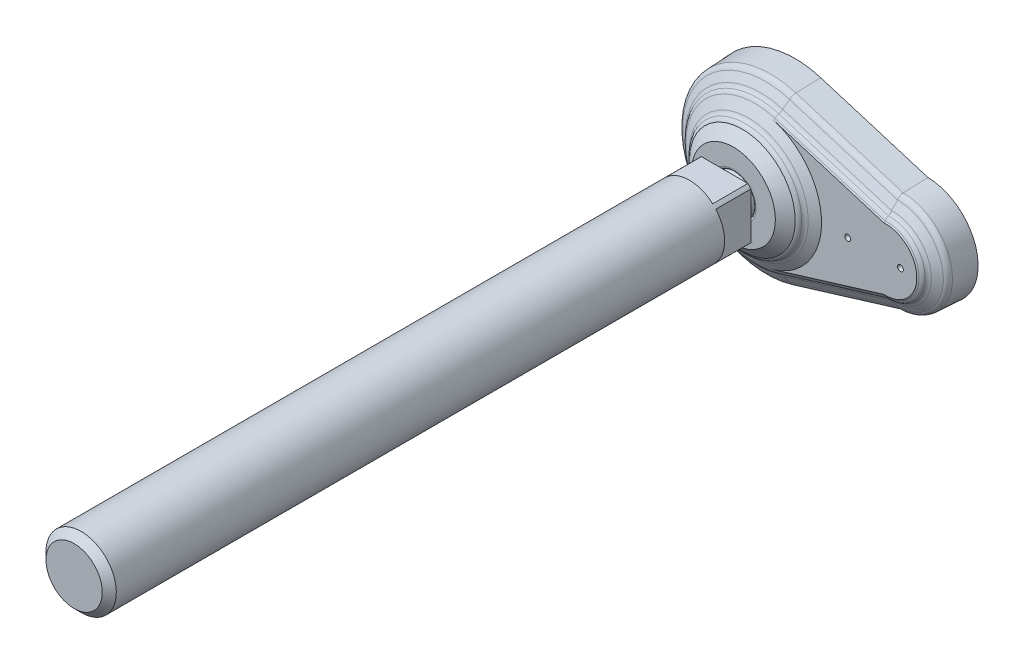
ISO-10303-21;
HEADER;
FILE_DESCRIPTION(('STEP AP214'),'2;1');
FILE_NAME('part.step','',(''),(''),'','','');
FILE_SCHEMA(('AUTOMOTIVE_DESIGN { 1 0 10303 214 1 1 1 1 }'));
ENDSEC;
DATA;
#1=APPLICATION_CONTEXT('core data for automotive mechanical design processes');
#2=APPLICATION_PROTOCOL_DEFINITION('international standard','automotive_design',2000,#1);
#3=PRODUCT_CONTEXT('',#1,'mechanical');
#4=PRODUCT('Part','Part','',(#3));
#5=PRODUCT_RELATED_PRODUCT_CATEGORY('part','',(#4));
#6=PRODUCT_DEFINITION_FORMATION('','',#4);
#7=PRODUCT_DEFINITION_CONTEXT('part definition',#1,'design');
#8=PRODUCT_DEFINITION('design','',#6,#7);
#9=PRODUCT_DEFINITION_SHAPE('','',#8);
#10=(LENGTH_UNIT() NAMED_UNIT(*) SI_UNIT(.MILLI.,.METRE.));
#11=(NAMED_UNIT(*) PLANE_ANGLE_UNIT() SI_UNIT($,.RADIAN.));
#12=(NAMED_UNIT(*) SI_UNIT($,.STERADIAN.) SOLID_ANGLE_UNIT());
#13=UNCERTAINTY_MEASURE_WITH_UNIT(LENGTH_MEASURE(1.E-05),#10,'distance_accuracy_value','');
#14=(GEOMETRIC_REPRESENTATION_CONTEXT(3) GLOBAL_UNCERTAINTY_ASSIGNED_CONTEXT((#13)) GLOBAL_UNIT_ASSIGNED_CONTEXT((#10,
#11,#12)) REPRESENTATION_CONTEXT('',''));
#15=CARTESIAN_POINT('',(0.,0.,0.));
#16=DIRECTION('',(0.,0.,1.));
#17=DIRECTION('',(1.,0.,0.));
#18=AXIS2_PLACEMENT_3D('',#15,#16,#17);
#19=CARTESIAN_POINT('',(0.,0.,36.));
#20=DIRECTION('',(0.,0.,1.));
#21=DIRECTION('',(-1.,0.,0.));
#22=AXIS2_PLACEMENT_3D('',#19,#20,#21);
#23=CYLINDRICAL_SURFACE('',#22,12.);
#24=CARTESIAN_POINT('',(0.,0.,243.6));
#25=DIRECTION('',(0.,0.,1.));
#26=DIRECTION('',(-1.,0.,0.));
#27=AXIS2_PLACEMENT_3D('',#24,#25,#26);
#28=CIRCLE('',#27,12.);
#29=CARTESIAN_POINT('',(-12.,0.,243.6));
#30=VERTEX_POINT('',#29);
#31=EDGE_CURVE('E9',#30,#30,#28,.F.);
#32=ORIENTED_EDGE('',*,*,#31,.T.);
#33=EDGE_LOOP('',(#32));
#34=FACE_BOUND('',#33,.T.);
#35=DIRECTION('',(0.,0.,1.));
#36=VECTOR('',#35,1.);
#37=CARTESIAN_POINT('',(-7.93725393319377,-9.,36.));
#38=LINE('',#37,#36);
#39=CARTESIAN_POINT('',(-7.93725393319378,-9.,36.));
#40=VERTEX_POINT('',#39);
#41=CARTESIAN_POINT('',(-7.93725393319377,-9.,24.));
#42=VERTEX_POINT('',#41);
#43=EDGE_CURVE('E136',#40,#42,#38,.F.);
#44=ORIENTED_EDGE('',*,*,#43,.F.);
#45=CARTESIAN_POINT('',(0.,0.,36.));
#46=DIRECTION('',(0.,0.,1.));
#47=DIRECTION('',(0.,-1.,0.));
#48=AXIS2_PLACEMENT_3D('',#45,#46,#47);
#49=CIRCLE('',#48,12.);
#50=CARTESIAN_POINT('',(7.93725393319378,-9.,36.));
#51=VERTEX_POINT('',#50);
#52=EDGE_CURVE('E598',#40,#51,#49,.T.);
#53=ORIENTED_EDGE('',*,*,#52,.T.);
#54=DIRECTION('',(0.,0.,1.));
#55=VECTOR('',#54,1.);
#56=CARTESIAN_POINT('',(7.93725393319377,-9.,36.));
#57=LINE('',#56,#55);
#58=CARTESIAN_POINT('',(7.93725393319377,-9.,24.));
#59=VERTEX_POINT('',#58);
#60=EDGE_CURVE('E201',#59,#51,#57,.T.);
#61=ORIENTED_EDGE('',*,*,#60,.F.);
#62=CARTESIAN_POINT('',(0.,0.,24.));
#63=DIRECTION('',(0.,0.,1.));
#64=DIRECTION('',(-1.,0.,0.));
#65=AXIS2_PLACEMENT_3D('',#62,#63,#64);
#66=CIRCLE('',#65,12.);
#67=CARTESIAN_POINT('',(9.,-7.93725393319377,24.));
#68=VERTEX_POINT('',#67);
#69=EDGE_CURVE('E184',#59,#68,#66,.T.);
#70=ORIENTED_EDGE('',*,*,#69,.T.);
#71=DIRECTION('',(0.,0.,1.));
#72=VECTOR('',#71,1.);
#73=CARTESIAN_POINT('',(9.,-7.93725393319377,36.));
#74=LINE('',#73,#72);
#75=CARTESIAN_POINT('',(9.,-7.93725393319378,36.));
#76=VERTEX_POINT('',#75);
#77=EDGE_CURVE('E198',#76,#68,#74,.F.);
#78=ORIENTED_EDGE('',*,*,#77,.F.);
#79=CARTESIAN_POINT('',(9.,7.93725393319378,36.));
#80=VERTEX_POINT('',#79);
#81=EDGE_CURVE('E266',#76,#80,#49,.T.);
#82=ORIENTED_EDGE('',*,*,#81,.T.);
#83=DIRECTION('',(0.,0.,1.));
#84=VECTOR('',#83,1.);
#85=CARTESIAN_POINT('',(9.,7.93725393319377,36.));
#86=LINE('',#85,#84);
#87=CARTESIAN_POINT('',(9.,7.93725393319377,24.));
#88=VERTEX_POINT('',#87);
#89=EDGE_CURVE('E243',#88,#80,#86,.T.);
#90=ORIENTED_EDGE('',*,*,#89,.F.);
#91=CARTESIAN_POINT('',(7.93725393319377,9.,24.));
#92=VERTEX_POINT('',#91);
#93=EDGE_CURVE('E180',#88,#92,#66,.T.);
#94=ORIENTED_EDGE('',*,*,#93,.T.);
#95=DIRECTION('',(0.,0.,1.));
#96=VECTOR('',#95,1.);
#97=CARTESIAN_POINT('',(7.93725393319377,9.,36.));
#98=LINE('',#97,#96);
#99=CARTESIAN_POINT('',(7.93725393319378,9.,36.));
#100=VERTEX_POINT('',#99);
#101=EDGE_CURVE('E161',#100,#92,#98,.F.);
#102=ORIENTED_EDGE('',*,*,#101,.F.);
#103=CARTESIAN_POINT('',(-7.93725393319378,9.,36.));
#104=VERTEX_POINT('',#103);
#105=EDGE_CURVE('E174',#100,#104,#49,.T.);
#106=ORIENTED_EDGE('',*,*,#105,.T.);
#107=DIRECTION('',(0.,0.,1.));
#108=VECTOR('',#107,1.);
#109=CARTESIAN_POINT('',(-7.93725393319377,9.,36.));
#110=LINE('',#109,#108);
#111=CARTESIAN_POINT('',(-7.93725393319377,9.,24.));
#112=VERTEX_POINT('',#111);
#113=EDGE_CURVE('E159',#112,#104,#110,.T.);
#114=ORIENTED_EDGE('',*,*,#113,.F.);
#115=CARTESIAN_POINT('',(-9.,7.93725393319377,24.));
#116=VERTEX_POINT('',#115);
#117=EDGE_CURVE('E172',#112,#116,#66,.T.);
#118=ORIENTED_EDGE('',*,*,#117,.T.);
#119=DIRECTION('',(0.,0.,1.));
#120=VECTOR('',#119,1.);
#121=CARTESIAN_POINT('',(-9.,7.93725393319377,36.));
#122=LINE('',#121,#120);
#123=CARTESIAN_POINT('',(-9.,7.93725393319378,36.));
#124=VERTEX_POINT('',#123);
#125=EDGE_CURVE('E175',#124,#116,#122,.F.);
#126=ORIENTED_EDGE('',*,*,#125,.F.);
#127=CARTESIAN_POINT('',(-9.,-7.93725393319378,36.));
#128=VERTEX_POINT('',#127);
#129=EDGE_CURVE('E599',#124,#128,#49,.T.);
#130=ORIENTED_EDGE('',*,*,#129,.T.);
#131=DIRECTION('',(0.,0.,1.));
#132=VECTOR('',#131,1.);
#133=CARTESIAN_POINT('',(-9.,-7.93725393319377,36.));
#134=LINE('',#133,#132);
#135=CARTESIAN_POINT('',(-9.,-7.93725393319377,24.));
#136=VERTEX_POINT('',#135);
#137=EDGE_CURVE('E181',#136,#128,#134,.T.);
#138=ORIENTED_EDGE('',*,*,#137,.F.);
#139=EDGE_CURVE('E183',#136,#42,#66,.T.);
#140=ORIENTED_EDGE('',*,*,#139,.T.);
#141=EDGE_LOOP('',(#44,#53,#61,#70,#78,#82,#90,#94,#102,#106,#114,#118,#126,#130,#138,#140));
#142=FACE_BOUND('',#141,.T.);
#143=ADVANCED_FACE('F14',(#34,#142),#23,.T.);
#144=CARTESIAN_POINT('',(-5.24903501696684,0.,24.));
#145=DIRECTION('',(0.,0.,1.));
#146=DIRECTION('',(-1.,0.,0.));
#147=AXIS2_PLACEMENT_3D('',#144,#145,#146);
#148=PLANE('',#147);
#149=DIRECTION('',(0.,-1.,0.));
#150=VECTOR('',#149,1.);
#151=CARTESIAN_POINT('',(-9.,9.,24.));
#152=LINE('',#151,#150);
#153=EDGE_CURVE('E31',#116,#136,#152,.T.);
#154=ORIENTED_EDGE('',*,*,#153,.F.);
#155=ORIENTED_EDGE('',*,*,#117,.F.);
#156=DIRECTION('',(-1.,0.,0.));
#157=VECTOR('',#156,1.);
#158=CARTESIAN_POINT('',(9.,9.,24.));
#159=LINE('',#158,#157);
#160=EDGE_CURVE('E154',#92,#112,#159,.T.);
#161=ORIENTED_EDGE('',*,*,#160,.F.);
#162=ORIENTED_EDGE('',*,*,#93,.F.);
#163=DIRECTION('',(0.,1.,0.));
#164=VECTOR('',#163,1.);
#165=CARTESIAN_POINT('',(9.,-9.,24.));
#166=LINE('',#165,#164);
#167=EDGE_CURVE('E166',#68,#88,#166,.T.);
#168=ORIENTED_EDGE('',*,*,#167,.F.);
#169=ORIENTED_EDGE('',*,*,#69,.F.);
#170=DIRECTION('',(1.,0.,0.));
#171=VECTOR('',#170,1.);
#172=CARTESIAN_POINT('',(-9.,-9.,24.));
#173=LINE('',#172,#171);
#174=EDGE_CURVE('E203',#42,#59,#173,.T.);
#175=ORIENTED_EDGE('',*,*,#174,.F.);
#176=ORIENTED_EDGE('',*,*,#139,.F.);
#177=EDGE_LOOP('',(#154,#155,#161,#162,#168,#169,#175,#176));
#178=FACE_BOUND('',#177,.T.);
#179=CARTESIAN_POINT('',(0.,0.,24.));
#180=DIRECTION('',(0.,0.,1.));
#181=DIRECTION('',(-1.,0.,0.));
#182=AXIS2_PLACEMENT_3D('',#179,#180,#181);
#183=CIRCLE('',#182,5.24903501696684);
#184=CARTESIAN_POINT('',(-5.24903501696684,0.,24.));
#185=VERTEX_POINT('',#184);
#186=EDGE_CURVE('E189',#185,#185,#183,.T.);
#187=ORIENTED_EDGE('',*,*,#186,.T.);
#188=EDGE_LOOP('',(#187));
#189=FACE_BOUND('',#188,.T.);
#190=ADVANCED_FACE('F177',(#178,#189),#148,.F.);
#191=CARTESIAN_POINT('',(0.,0.,17.6309999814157));
#192=DIRECTION('',(0.,0.,1.));
#193=DIRECTION('',(-1.,0.,0.));
#194=AXIS2_PLACEMENT_3D('',#191,#192,#193);
#195=DEGENERATE_TOROIDAL_SURFACE('',#194,0.0005038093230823,6.829,.T.);
#196=CARTESIAN_POINT('',(0.,0.,18.775));
#197=DIRECTION('',(0.,0.,-1.));
#198=DIRECTION('',(1.,0.,0.));
#199=AXIS2_PLACEMENT_3D('',#196,#197,#198);
#200=CIRCLE('',#199,6.733);
#201=CARTESIAN_POINT('',(6.733,0.,18.775));
#202=VERTEX_POINT('',#201);
#203=EDGE_CURVE('E250',#202,#202,#200,.T.);
#204=ORIENTED_EDGE('',*,*,#203,.F.);
#205=EDGE_LOOP('',(#204));
#206=FACE_BOUND('',#205,.T.);
#207=CARTESIAN_POINT('',(0.,0.,22.));
#208=DIRECTION('',(0.,0.,1.));
#209=DIRECTION('',(-1.,0.,0.));
#210=AXIS2_PLACEMENT_3D('',#207,#208,#209);
#211=CIRCLE('',#210,5.24903501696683);
#212=CARTESIAN_POINT('',(-5.24903501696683,0.,22.));
#213=VERTEX_POINT('',#212);
#214=EDGE_CURVE('E191',#213,#213,#211,.T.);
#215=ORIENTED_EDGE('',*,*,#214,.F.);
#216=EDGE_LOOP('',(#215));
#217=FACE_BOUND('',#216,.T.);
#218=ADVANCED_FACE('F472',(#206,#217),#195,.T.);
#219=CARTESIAN_POINT('',(0.,0.,36.));
#220=DIRECTION('',(0.,0.,1.));
#221=DIRECTION('',(-1.,0.,0.));
#222=AXIS2_PLACEMENT_3D('',#219,#220,#221);
#223=CYLINDRICAL_SURFACE('',#222,5.24903501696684);
#224=ORIENTED_EDGE('',*,*,#186,.F.);
#225=EDGE_LOOP('',(#224));
#226=FACE_BOUND('',#225,.T.);
#227=ORIENTED_EDGE('',*,*,#214,.T.);
#228=EDGE_LOOP('',(#227));
#229=FACE_BOUND('',#228,.T.);
#230=ADVANCED_FACE('F574',(#226,#229),#223,.T.);
#231=CARTESIAN_POINT('',(-9.,-9.,24.));
#232=DIRECTION('',(0.,-1.,0.));
#233=DIRECTION('',(1.,0.,0.));
#234=AXIS2_PLACEMENT_3D('',#231,#232,#233);
#235=PLANE('',#234);
#236=ORIENTED_EDGE('',*,*,#60,.T.);
#237=DIRECTION('',(-1.,0.,0.));
#238=VECTOR('',#237,1.);
#239=CARTESIAN_POINT('',(-12.,-9.,36.));
#240=LINE('',#239,#238);
#241=EDGE_CURVE('E215',#51,#40,#240,.T.);
#242=ORIENTED_EDGE('',*,*,#241,.T.);
#243=ORIENTED_EDGE('',*,*,#43,.T.);
#244=ORIENTED_EDGE('',*,*,#174,.T.);
#245=EDGE_LOOP('',(#236,#242,#243,#244));
#246=FACE_BOUND('',#245,.T.);
#247=ADVANCED_FACE('F572',(#246),#235,.T.);
#248=CARTESIAN_POINT('',(9.,-9.,24.));
#249=DIRECTION('',(1.,0.,0.));
#250=DIRECTION('',(0.,1.,0.));
#251=AXIS2_PLACEMENT_3D('',#248,#249,#250);
#252=PLANE('',#251);
#253=ORIENTED_EDGE('',*,*,#89,.T.);
#254=DIRECTION('',(0.,-1.,0.));
#255=VECTOR('',#254,1.);
#256=CARTESIAN_POINT('',(9.,0.,36.));
#257=LINE('',#256,#255);
#258=EDGE_CURVE('E222',#80,#76,#257,.T.);
#259=ORIENTED_EDGE('',*,*,#258,.T.);
#260=ORIENTED_EDGE('',*,*,#77,.T.);
#261=ORIENTED_EDGE('',*,*,#167,.T.);
#262=EDGE_LOOP('',(#253,#259,#260,#261));
#263=FACE_BOUND('',#262,.T.);
#264=ADVANCED_FACE('F568',(#263),#252,.T.);
#265=CARTESIAN_POINT('',(9.,9.,24.));
#266=DIRECTION('',(0.,1.,0.));
#267=DIRECTION('',(-1.,0.,0.));
#268=AXIS2_PLACEMENT_3D('',#265,#266,#267);
#269=PLANE('',#268);
#270=ORIENTED_EDGE('',*,*,#113,.T.);
#271=DIRECTION('',(1.,0.,0.));
#272=VECTOR('',#271,1.);
#273=CARTESIAN_POINT('',(-12.,9.,36.));
#274=LINE('',#273,#272);
#275=EDGE_CURVE('E226',#104,#100,#274,.T.);
#276=ORIENTED_EDGE('',*,*,#275,.T.);
#277=ORIENTED_EDGE('',*,*,#101,.T.);
#278=ORIENTED_EDGE('',*,*,#160,.T.);
#279=EDGE_LOOP('',(#270,#276,#277,#278));
#280=FACE_BOUND('',#279,.T.);
#281=ADVANCED_FACE('F156',(#280),#269,.T.);
#282=CARTESIAN_POINT('',(-9.,9.,24.));
#283=DIRECTION('',(-1.,0.,0.));
#284=DIRECTION('',(0.,-1.,0.));
#285=AXIS2_PLACEMENT_3D('',#282,#283,#284);
#286=PLANE('',#285);
#287=ORIENTED_EDGE('',*,*,#137,.T.);
#288=DIRECTION('',(0.,1.,0.));
#289=VECTOR('',#288,1.);
#290=CARTESIAN_POINT('',(-9.,0.,36.));
#291=LINE('',#290,#289);
#292=EDGE_CURVE('E239',#128,#124,#291,.T.);
#293=ORIENTED_EDGE('',*,*,#292,.T.);
#294=ORIENTED_EDGE('',*,*,#125,.T.);
#295=ORIENTED_EDGE('',*,*,#153,.T.);
#296=EDGE_LOOP('',(#287,#293,#294,#295));
#297=FACE_BOUND('',#296,.T.);
#298=ADVANCED_FACE('F482',(#297),#286,.T.);
#299=CARTESIAN_POINT('',(45.,0.,0.));
#300=DIRECTION('',(0.,0.,-1.));
#301=DIRECTION('',(0.,1.,0.));
#302=AXIS2_PLACEMENT_3D('',#299,#300,#301);
#303=CONICAL_SURFACE('',#302,17.5,0.0523365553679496);
#304=CARTESIAN_POINT('',(45.,0.,8.304));
#305=DIRECTION('',(0.,0.,1.));
#306=DIRECTION('',(0.,-1.,0.));
#307=AXIS2_PLACEMENT_3D('',#304,#305,#306);
#308=CIRCLE('',#307,17.065);
#309=CARTESIAN_POINT('',(45.3136024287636,-17.0621182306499,8.304));
#310=VERTEX_POINT('',#309);
#311=CARTESIAN_POINT('',(45.3136024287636,17.0621182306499,8.304));
#312=VERTEX_POINT('',#311);
#313=EDGE_CURVE('E304',#310,#312,#308,.T.);
#314=ORIENTED_EDGE('',*,*,#313,.F.);
#315=CARTESIAN_POINT('',(45.3136007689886,-17.0621077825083,8.3042));
#316=CARTESIAN_POINT('',(45.3250873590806,-17.134412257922,6.92013380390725));
#317=CARTESIAN_POINT('',(45.3366049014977,-17.206707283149,5.5360673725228));
#318=CARTESIAN_POINT('',(45.3597018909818,-17.3512784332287,2.76793403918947));
#319=CARTESIAN_POINT('',(45.3712813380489,-17.4235545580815,1.38386713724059));
#320=CARTESIAN_POINT('',(45.3828917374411,-17.4958212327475,-0.000200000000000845));
#321=B_SPLINE_CURVE_WITH_KNOTS('',3,(#315,#316,#317,#318,#319,#320),.UNSPECIFIED.,.F.,.F.,(4,2,
4),(0.,4.15800336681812,8.31600673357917),.UNSPECIFIED.);
#322=CARTESIAN_POINT('',(45.3828900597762,-17.4958107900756,0.));
#323=VERTEX_POINT('',#322);
#324=EDGE_CURVE('E949',#310,#323,#321,.T.);
#325=ORIENTED_EDGE('',*,*,#324,.T.);
#326=CARTESIAN_POINT('',(45.,0.,0.));
#327=DIRECTION('',(0.,0.,1.));
#328=DIRECTION('',(0.,-1.,0.));
#329=AXIS2_PLACEMENT_3D('',#326,#327,#328);
#330=CIRCLE('',#329,17.5);
#331=CARTESIAN_POINT('',(45.3828900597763,17.4958107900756,0.));
#332=VERTEX_POINT('',#331);
#333=EDGE_CURVE('E307',#323,#332,#330,.T.);
#334=ORIENTED_EDGE('',*,*,#333,.T.);
#335=CARTESIAN_POINT('',(45.3828917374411,17.4958212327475,-0.000200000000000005));
#336=CARTESIAN_POINT('',(45.371281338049,17.4235545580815,1.38386713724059));
#337=CARTESIAN_POINT('',(45.359701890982,17.3512784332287,2.76793403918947));
#338=CARTESIAN_POINT('',(45.3366049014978,17.206707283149,5.5360673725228));
#339=CARTESIAN_POINT('',(45.3250873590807,17.134412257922,6.92013380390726));
#340=CARTESIAN_POINT('',(45.3136007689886,17.0621077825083,8.3042));
#341=B_SPLINE_CURVE_WITH_KNOTS('',3,(#335,#336,#337,#338,#339,#340),.UNSPECIFIED.,.F.,.F.,(4,2,
4),(0.,4.15800336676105,8.31600673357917),.UNSPECIFIED.);
#342=EDGE_CURVE('E942',#332,#312,#341,.T.);
#343=ORIENTED_EDGE('',*,*,#342,.T.);
#344=EDGE_LOOP('',(#314,#325,#334,#343));
#345=FACE_BOUND('',#344,.T.);
#346=ADVANCED_FACE('F362',(#345),#303,.T.);
#347=CARTESIAN_POINT('',(46.8961596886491,-16.5782819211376,8.304));
#348=DIRECTION('',(-0.291971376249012,0.9549953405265,-0.0523126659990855));
#349=DIRECTION('',(-0.956304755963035,-0.292371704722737,0.));
#350=AXIS2_PLACEMENT_3D('',#347,#348,#349);
#351=PLANE('',#350);
#352=ORIENTED_EDGE('',*,*,#324,.F.);
#353=DIRECTION('',(-0.956304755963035,-0.292371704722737,0.));
#354=VECTOR('',#353,1.);
#355=CARTESIAN_POINT('',(46.8961596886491,-16.5782819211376,8.304));
#356=LINE('',#355,#354);
#357=CARTESIAN_POINT('',(8.64396945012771,-28.2731501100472,8.304));
#358=VERTEX_POINT('',#357);
#359=EDGE_CURVE('E974',#310,#358,#356,.T.);
#360=ORIENTED_EDGE('',*,*,#359,.T.);
#361=DIRECTION('',(-0.0152947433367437,0.050026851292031,0.998630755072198));
#362=VECTOR('',#361,1.);
#363=CARTESIAN_POINT('',(8.7711511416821,-28.689142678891,0.));
#364=LINE('',#363,#362);
#365=CARTESIAN_POINT('',(8.7711511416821,-28.689142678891,0.));
#366=VERTEX_POINT('',#365);
#367=EDGE_CURVE('E987',#366,#358,#364,.T.);
#368=ORIENTED_EDGE('',*,*,#367,.F.);
#369=DIRECTION('',(-0.956304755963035,-0.292371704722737,0.));
#370=VECTOR('',#369,1.);
#371=CARTESIAN_POINT('',(47.0233413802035,-16.9942744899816,0.));
#372=LINE('',#371,#370);
#373=EDGE_CURVE('E127',#323,#366,#372,.T.);
#374=ORIENTED_EDGE('',*,*,#373,.F.);
#375=EDGE_LOOP('',(#352,#360,#368,#374));
#376=FACE_BOUND('',#375,.T.);
#377=ADVANCED_FACE('F468',(#376),#351,.F.);
#378=CARTESIAN_POINT('',(0.,0.,0.));
#379=DIRECTION('',(0.,0.,1.));
#380=DIRECTION('',(0.,-1.,0.));
#381=AXIS2_PLACEMENT_3D('',#378,#379,#380);
#382=PLANE('',#381);
#383=DIRECTION('',(-0.956304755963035,0.292371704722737,0.));
#384=VECTOR('',#383,1.);
#385=CARTESIAN_POINT('',(47.0233413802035,16.9942744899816,0.));
#386=LINE('',#385,#384);
#387=CARTESIAN_POINT('',(8.7711511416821,28.689142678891,0.));
#388=VERTEX_POINT('',#387);
#389=EDGE_CURVE('E972',#332,#388,#386,.T.);
#390=ORIENTED_EDGE('',*,*,#389,.F.);
#391=ORIENTED_EDGE('',*,*,#333,.F.);
#392=ORIENTED_EDGE('',*,*,#373,.T.);
#393=CARTESIAN_POINT('',(0.,0.,0.));
#394=DIRECTION('',(0.,0.,1.));
#395=DIRECTION('',(0.,-1.,0.));
#396=AXIS2_PLACEMENT_3D('',#393,#394,#395);
#397=CIRCLE('',#396,30.);
#398=EDGE_CURVE('E351',#388,#366,#397,.T.);
#399=ORIENTED_EDGE('',*,*,#398,.F.);
#400=EDGE_LOOP('',(#390,#391,#392,#399));
#401=FACE_BOUND('',#400,.T.);
#402=CARTESIAN_POINT('',(32.,0.,0.));
#403=DIRECTION('',(0.,0.,-1.));
#404=DIRECTION('',(0.,1.,0.));
#405=AXIS2_PLACEMENT_3D('',#402,#403,#404);
#406=CIRCLE('',#405,4.25);
#407=CARTESIAN_POINT('',(32.,4.25,0.));
#408=VERTEX_POINT('',#407);
#409=EDGE_CURVE('E600',#408,#408,#406,.T.);
#410=ORIENTED_EDGE('',*,*,#409,.F.);
#411=EDGE_LOOP('',(#410));
#412=FACE_BOUND('',#411,.T.);
#413=CARTESIAN_POINT('',(50.,0.,0.));
#414=DIRECTION('',(0.,0.,-1.));
#415=DIRECTION('',(0.,1.,0.));
#416=AXIS2_PLACEMENT_3D('',#413,#414,#415);
#417=CIRCLE('',#416,4.25);
#418=CARTESIAN_POINT('',(50.,4.25,0.));
#419=VERTEX_POINT('',#418);
#420=EDGE_CURVE('E603',#419,#419,#417,.T.);
#421=ORIENTED_EDGE('',*,*,#420,.F.);
#422=EDGE_LOOP('',(#421));
#423=FACE_BOUND('',#422,.T.);
#424=ADVANCED_FACE('F360',(#401,#412,#423),#382,.F.);
#425=CARTESIAN_POINT('',(47.0233413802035,16.9942744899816,0.));
#426=DIRECTION('',(-0.291971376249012,-0.9549953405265,-0.0523126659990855));
#427=DIRECTION('',(0.956304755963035,-0.292371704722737,0.));
#428=AXIS2_PLACEMENT_3D('',#425,#426,#427);
#429=PLANE('',#428);
#430=ORIENTED_EDGE('',*,*,#342,.F.);
#431=ORIENTED_EDGE('',*,*,#389,.T.);
#432=DIRECTION('',(-0.0152947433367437,-0.050026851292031,0.998630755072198));
#433=VECTOR('',#432,1.);
#434=CARTESIAN_POINT('',(8.7711511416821,28.689142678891,0.));
#435=LINE('',#434,#433);
#436=CARTESIAN_POINT('',(8.64396945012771,28.2731501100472,8.304));
#437=VERTEX_POINT('',#436);
#438=EDGE_CURVE('E1004',#388,#437,#435,.T.);
#439=ORIENTED_EDGE('',*,*,#438,.T.);
#440=DIRECTION('',(-0.956304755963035,0.292371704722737,0.));
#441=VECTOR('',#440,1.);
#442=CARTESIAN_POINT('',(46.8961596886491,16.5782819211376,8.304));
#443=LINE('',#442,#441);
#444=EDGE_CURVE('E970',#312,#437,#443,.T.);
#445=ORIENTED_EDGE('',*,*,#444,.F.);
#446=EDGE_LOOP('',(#430,#431,#439,#445));
#447=FACE_BOUND('',#446,.T.);
#448=ADVANCED_FACE('F438',(#447),#429,.F.);
#449=CARTESIAN_POINT('',(45.,0.,8.20868962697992));
#450=DIRECTION('',(0.,0.,1.));
#451=DIRECTION('',(0.,-1.,0.));
#452=AXIS2_PLACEMENT_3D('',#449,#450,#451);
#453=TOROIDAL_SURFACE('',#452,15.0672723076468,2.);
#454=CARTESIAN_POINT('',(45.313603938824,-17.062127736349,8.3038));
#455=CARTESIAN_POINT('',(45.3131828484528,-17.0594763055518,8.3596419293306));
#456=CARTESIAN_POINT('',(45.3123906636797,-17.0544900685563,8.41534315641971));
#457=CARTESIAN_POINT('',(45.3100724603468,-17.0398916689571,8.52611669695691));
#458=CARTESIAN_POINT('',(45.3085464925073,-17.0302798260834,8.5811890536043));
#459=CARTESIAN_POINT('',(45.3028875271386,-16.9946160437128,8.7447437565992));
#460=CARTESIAN_POINT('',(45.2976717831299,-16.9617253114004,8.85178061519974));
#461=CARTESIAN_POINT('',(45.284530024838,-16.8786837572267,9.05872519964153));
#462=CARTESIAN_POINT('',(45.2766032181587,-16.8285278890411,9.1586308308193));
#463=CARTESIAN_POINT('',(45.2583029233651,-16.7124179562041,9.34857034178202));
#464=CARTESIAN_POINT('',(45.24792931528,-16.6464631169,9.43860373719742));
#465=CARTESIAN_POINT('',(45.2250216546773,-16.5003240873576,9.60671335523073));
#466=CARTESIAN_POINT('',(45.2124772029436,-16.4200713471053,9.68472843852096));
#467=CARTESIAN_POINT('',(45.1856662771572,-16.2478592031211,9.8261370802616));
#468=CARTESIAN_POINT('',(45.1714009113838,-16.1559073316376,9.88953997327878));
#469=CARTESIAN_POINT('',(45.148748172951,-16.0092275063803,9.97356807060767));
#470=CARTESIAN_POINT('',(45.1408156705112,-15.957749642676,10.0001426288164));
#471=CARTESIAN_POINT('',(45.1246863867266,-15.8528232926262,10.0486569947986));
#472=CARTESIAN_POINT('',(45.1164901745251,-15.7993790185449,10.0706061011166));
#473=CARTESIAN_POINT('',(45.1081834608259,-15.7450737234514,10.0902));
#474=B_SPLINE_CURVE_WITH_KNOTS('',3,(#454,#455,#456,#457,#458,#459,#460,#461,#462,#463,#464,
#465,#466,#467,#468,#469,#470,#471,#472,#473),.UNSPECIFIED.,.F.,.F.,(4,2,2,2,2,2,2,2,2,4),(0.,
0.167615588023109,0.335219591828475,0.669784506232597,1.00444729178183,1.33912648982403,
1.67545571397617,2.01156948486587,2.1867983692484,2.36167155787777),.UNSPECIFIED.);
#475=CARTESIAN_POINT('',(45.108268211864,-15.7456277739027,10.09));
#476=VERTEX_POINT('',#475);
#477=EDGE_CURVE('E950',#310,#476,#474,.T.);
#478=ORIENTED_EDGE('',*,*,#477,.F.);
#479=ORIENTED_EDGE('',*,*,#313,.T.);
#480=CARTESIAN_POINT('',(45.1081834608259,15.7450737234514,10.0902));
#481=CARTESIAN_POINT('',(45.1162755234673,15.7979756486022,10.0711117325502));
#482=CARTESIAN_POINT('',(45.1242625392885,15.8500594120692,10.0497900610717));
#483=CARTESIAN_POINT('',(45.1399729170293,15.9522733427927,10.0028085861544));
#484=CARTESIAN_POINT('',(45.1476962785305,16.0024035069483,9.97714877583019));
#485=CARTESIAN_POINT('',(45.170371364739,16.1492634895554,9.89392549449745));
#486=CARTESIAN_POINT('',(45.1848488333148,16.2425982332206,9.83006921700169));
#487=CARTESIAN_POINT('',(45.2120467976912,16.4173167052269,9.6873614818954));
#488=CARTESIAN_POINT('',(45.2247661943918,16.4986929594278,9.60850071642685));
#489=CARTESIAN_POINT('',(45.2480269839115,16.647087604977,9.4379734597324));
#490=CARTESIAN_POINT('',(45.2585686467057,16.7141077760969,9.34630855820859));
#491=CARTESIAN_POINT('',(45.2770522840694,16.8313730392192,9.15345563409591));
#492=CARTESIAN_POINT('',(45.2850114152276,16.8817288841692,9.05233645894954));
#493=CARTESIAN_POINT('',(45.298151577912,16.9647535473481,8.84294631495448));
#494=CARTESIAN_POINT('',(45.3033350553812,16.9974379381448,8.73468173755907));
#495=CARTESIAN_POINT('',(45.3088197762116,17.0320013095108,8.57167924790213));
#496=CARTESIAN_POINT('',(45.3102579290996,17.0410597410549,8.51840996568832));
#497=CARTESIAN_POINT('',(45.3124461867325,17.0548396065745,8.41140374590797));
#498=CARTESIAN_POINT('',(45.3131976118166,17.0595693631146,8.35766790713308));
#499=CARTESIAN_POINT('',(45.313603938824,17.062127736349,8.3038));
#500=B_SPLINE_CURVE_WITH_KNOTS('',3,(#480,#481,#482,#483,#484,#485,#486,#487,#488,#489,#490,
#491,#492,#493,#494,#495,#496,#497,#498,#499),.UNSPECIFIED.,.F.,.F.,(4,2,2,2,2,2,2,2,2,4),(0.,
0.170355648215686,0.340711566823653,0.680992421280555,1.02148505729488,1.36193545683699,
1.70007548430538,2.03791704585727,2.19992239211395,2.36161559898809),.UNSPECIFIED.);
#501=CARTESIAN_POINT('',(45.1082682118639,15.7456277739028,10.09));
#502=VERTEX_POINT('',#501);
#503=EDGE_CURVE('E427',#502,#312,#500,.T.);
#504=ORIENTED_EDGE('',*,*,#503,.F.);
#505=CARTESIAN_POINT('',(45.,0.,10.09));
#506=DIRECTION('',(0.,0.,1.));
#507=DIRECTION('',(0.,-1.,0.));
#508=AXIS2_PLACEMENT_3D('',#505,#506,#507);
#509=CIRCLE('',#508,15.746);
#510=EDGE_CURVE('E301',#476,#502,#509,.T.);
#511=ORIENTED_EDGE('',*,*,#510,.F.);
#512=EDGE_LOOP('',(#478,#479,#504,#511));
#513=FACE_BOUND('',#512,.T.);
#514=ADVANCED_FACE('F411',(#513),#453,.T.);
#515=CARTESIAN_POINT('',(46.312080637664,-14.6678454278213,8.20868962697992));
#516=DIRECTION('',(-0.956304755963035,-0.292371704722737,0.));
#517=DIRECTION('',(0.292371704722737,-0.956304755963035,0.));
#518=AXIS2_PLACEMENT_3D('',#515,#516,#517);
#519=CYLINDRICAL_SURFACE('',#518,2.);
#520=ORIENTED_EDGE('',*,*,#359,.F.);
#521=ORIENTED_EDGE('',*,*,#477,.T.);
#522=DIRECTION('',(-0.956304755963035,-0.292371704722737,0.));
#523=VECTOR('',#522,1.);
#524=CARTESIAN_POINT('',(46.5105214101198,-15.3169159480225,10.09));
#525=LINE('',#524,#523);
#526=CARTESIAN_POINT('',(8.25833117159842,-27.0117841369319,10.09));
#527=VERTEX_POINT('',#526);
#528=EDGE_CURVE('E976',#476,#527,#525,.T.);
#529=ORIENTED_EDGE('',*,*,#528,.T.);
#530=CARTESIAN_POINT('',(8.05989039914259,-26.3627136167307,8.20868962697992));
#531=DIRECTION('',(0.956304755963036,0.292371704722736,0.));
#532=DIRECTION('',(-0.292371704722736,0.956304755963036,0.));
#533=AXIS2_PLACEMENT_3D('',#530,#531,#532);
#534=CIRCLE('',#533,2.);
#535=EDGE_CURVE('E990',#527,#358,#534,.T.);
#536=ORIENTED_EDGE('',*,*,#535,.T.);
#537=EDGE_LOOP('',(#520,#521,#529,#536));
#538=FACE_BOUND('',#537,.T.);
#539=ADVANCED_FACE('F439',(#538),#519,.T.);
#540=CARTESIAN_POINT('',(0.,0.,0.));
#541=DIRECTION('',(0.,0.,-1.));
#542=DIRECTION('',(0.,1.,0.));
#543=AXIS2_PLACEMENT_3D('',#540,#541,#542);
#544=CONICAL_SURFACE('',#543,30.,0.0523365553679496);
#545=CARTESIAN_POINT('',(0.,0.,8.304));
#546=DIRECTION('',(0.,0.,1.));
#547=DIRECTION('',(0.,-1.,0.));
#548=AXIS2_PLACEMENT_3D('',#545,#546,#547);
#549=CIRCLE('',#548,29.565);
#550=EDGE_CURVE('E1033',#437,#358,#549,.T.);
#551=ORIENTED_EDGE('',*,*,#550,.F.);
#552=ORIENTED_EDGE('',*,*,#438,.F.);
#553=ORIENTED_EDGE('',*,*,#398,.T.);
#554=ORIENTED_EDGE('',*,*,#367,.T.);
#555=EDGE_LOOP('',(#551,#552,#553,#554));
#556=FACE_BOUND('',#555,.T.);
#557=ADVANCED_FACE('F459',(#556),#544,.T.);
#558=CARTESIAN_POINT('',(46.312080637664,14.6678454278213,8.20868962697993));
#559=DIRECTION('',(-0.956304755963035,0.292371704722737,0.));
#560=DIRECTION('',(-0.292371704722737,-0.956304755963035,0.));
#561=AXIS2_PLACEMENT_3D('',#558,#559,#560);
#562=CYLINDRICAL_SURFACE('',#561,2.);
#563=DIRECTION('',(-0.956304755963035,0.292371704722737,0.));
#564=VECTOR('',#563,1.);
#565=CARTESIAN_POINT('',(46.5105214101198,15.3169159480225,10.09));
#566=LINE('',#565,#564);
#567=CARTESIAN_POINT('',(8.25833117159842,27.0117841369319,10.09));
#568=VERTEX_POINT('',#567);
#569=EDGE_CURVE('E968',#502,#568,#566,.T.);
#570=ORIENTED_EDGE('',*,*,#569,.F.);
#571=ORIENTED_EDGE('',*,*,#503,.T.);
#572=ORIENTED_EDGE('',*,*,#444,.T.);
#573=CARTESIAN_POINT('',(8.05989039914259,26.3627136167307,8.20868962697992));
#574=DIRECTION('',(-0.956304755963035,0.292371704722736,0.));
#575=DIRECTION('',(-0.292371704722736,-0.956304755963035,0.));
#576=AXIS2_PLACEMENT_3D('',#573,#574,#575);
#577=CIRCLE('',#576,2.);
#578=EDGE_CURVE('E1007',#568,#437,#577,.T.);
#579=ORIENTED_EDGE('',*,*,#578,.F.);
#580=EDGE_LOOP('',(#570,#571,#572,#579));
#581=FACE_BOUND('',#580,.T.);
#582=ADVANCED_FACE('F370',(#581),#562,.T.);
#583=CARTESIAN_POINT('',(45.,0.,10.09));
#584=DIRECTION('',(0.,0.,-1.));
#585=DIRECTION('',(0.,1.,0.));
#586=AXIS2_PLACEMENT_3D('',#583,#584,#585);
#587=CONICAL_SURFACE('',#586,15.746,0.993858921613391);
#588=CARTESIAN_POINT('',(45.,0.,11.7170000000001));
#589=DIRECTION('',(0.,0.,1.));
#590=DIRECTION('',(0.,-1.,0.));
#591=AXIS2_PLACEMENT_3D('',#588,#589,#590);
#592=CIRCLE('',#591,13.2459999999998);
#593=CARTESIAN_POINT('',(44.7416637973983,-13.243480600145,11.7170000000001));
#594=VERTEX_POINT('',#593);
#595=CARTESIAN_POINT('',(44.7416637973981,13.2434806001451,11.7170000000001));
#596=VERTEX_POINT('',#595);
#597=EDGE_CURVE('E299',#594,#596,#592,.T.);
#598=ORIENTED_EDGE('',*,*,#597,.F.);
#599=CARTESIAN_POINT('',(44.7416208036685,-13.2431723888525,11.7172000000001));
#600=CARTESIAN_POINT('',(44.8000092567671,-13.66082442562,11.4461588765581));
#601=CARTESIAN_POINT('',(44.8597613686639,-14.078214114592,11.1750215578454));
#602=CARTESIAN_POINT('',(44.9819928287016,-14.9124682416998,10.6325548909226));
#603=CARTESIAN_POINT('',(45.0444721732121,-15.3293326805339,10.3612255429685));
#604=CARTESIAN_POINT('',(45.1083151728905,-15.745934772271,10.0898));
#605=B_SPLINE_CURVE_WITH_KNOTS('',3,(#599,#600,#601,#602,#603,#604),.UNSPECIFIED.,.F.,.F.,(4,2,
4),(0.,1.50389468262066,3.0077873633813),.UNSPECIFIED.);
#606=EDGE_CURVE('E420',#594,#476,#605,.T.);
#607=ORIENTED_EDGE('',*,*,#606,.T.);
#608=ORIENTED_EDGE('',*,*,#510,.T.);
#609=CARTESIAN_POINT('',(45.1083151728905,15.745934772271,10.0898));
#610=CARTESIAN_POINT('',(45.0444721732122,15.3293326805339,10.3612255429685));
#611=CARTESIAN_POINT('',(44.9819928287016,14.9124682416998,10.6325548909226));
#612=CARTESIAN_POINT('',(44.8597613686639,14.078214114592,11.1750215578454));
#613=CARTESIAN_POINT('',(44.8000092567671,13.66082442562,11.4461588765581));
#614=CARTESIAN_POINT('',(44.7416208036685,13.2431723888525,11.7172000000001));
#615=B_SPLINE_CURVE_WITH_KNOTS('',3,(#609,#610,#611,#612,#613,#614),.UNSPECIFIED.,.F.,.F.,(4,2,
4),(0.,1.50389268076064,3.0077873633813),.UNSPECIFIED.);
#616=EDGE_CURVE('E414',#502,#596,#615,.T.);
#617=ORIENTED_EDGE('',*,*,#616,.T.);
#618=EDGE_LOOP('',(#598,#607,#608,#617));
#619=FACE_BOUND('',#618,.T.);
#620=ADVANCED_FACE('F405',(#619),#587,.T.);
#621=CARTESIAN_POINT('',(45.7795921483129,-12.9261540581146,11.7170000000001));
#622=DIRECTION('',(-0.159476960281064,0.521625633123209,-0.838137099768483));
#623=DIRECTION('',(0.,0.849002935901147,0.528388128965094));
#624=AXIS2_PLACEMENT_3D('',#621,#622,#623);
#625=PLANE('',#624);
#626=ORIENTED_EDGE('',*,*,#606,.F.);
#627=DIRECTION('',(-0.956304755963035,-0.292371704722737,0.));
#628=VECTOR('',#627,1.);
#629=CARTESIAN_POINT('',(45.7795921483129,-12.9261540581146,11.7170000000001));
#630=LINE('',#629,#628);
#631=CARTESIAN_POINT('',(7.52740190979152,-24.6210222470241,11.7170000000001));
#632=VERTEX_POINT('',#631);
#633=EDGE_CURVE('E978',#594,#632,#630,.T.);
#634=ORIENTED_EDGE('',*,*,#633,.T.);
#635=DIRECTION('',(-0.245047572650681,0.801514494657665,0.545459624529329));
#636=VECTOR('',#635,1.);
#637=CARTESIAN_POINT('',(8.25833117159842,-27.0117841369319,10.09));
#638=LINE('',#637,#636);
#639=EDGE_CURVE('E993',#527,#632,#638,.T.);
#640=ORIENTED_EDGE('',*,*,#639,.F.);
#641=ORIENTED_EDGE('',*,*,#528,.F.);
#642=EDGE_LOOP('',(#626,#634,#640,#641));
#643=FACE_BOUND('',#642,.T.);
#644=ADVANCED_FACE('F409',(#643),#625,.F.);
#645=CARTESIAN_POINT('',(0.,0.,8.20868962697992));
#646=DIRECTION('',(0.,0.,1.));
#647=DIRECTION('',(0.,-1.,0.));
#648=AXIS2_PLACEMENT_3D('',#645,#646,#647);
#649=TOROIDAL_SURFACE('',#648,27.5672723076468,2.);
#650=CARTESIAN_POINT('',(0.,0.,10.09));
#651=DIRECTION('',(0.,0.,1.));
#652=DIRECTION('',(0.,-1.,0.));
#653=AXIS2_PLACEMENT_3D('',#650,#651,#652);
#654=CIRCLE('',#653,28.246);
#655=EDGE_CURVE('E1031',#568,#527,#654,.T.);
#656=ORIENTED_EDGE('',*,*,#655,.F.);
#657=ORIENTED_EDGE('',*,*,#578,.T.);
#658=ORIENTED_EDGE('',*,*,#550,.T.);
#659=ORIENTED_EDGE('',*,*,#535,.F.);
#660=EDGE_LOOP('',(#656,#657,#658,#659));
#661=FACE_BOUND('',#660,.T.);
#662=ADVANCED_FACE('F436',(#661),#649,.T.);
#663=CARTESIAN_POINT('',(46.5105214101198,15.3169159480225,10.09));
#664=DIRECTION('',(-0.159476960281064,-0.521625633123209,-0.838137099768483));
#665=DIRECTION('',(0.,0.849002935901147,-0.528388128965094));
#666=AXIS2_PLACEMENT_3D('',#663,#664,#665);
#667=PLANE('',#666);
#668=ORIENTED_EDGE('',*,*,#616,.F.);
#669=ORIENTED_EDGE('',*,*,#569,.T.);
#670=DIRECTION('',(-0.245047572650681,-0.801514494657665,0.545459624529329));
#671=VECTOR('',#670,1.);
#672=CARTESIAN_POINT('',(8.25833117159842,27.0117841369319,10.09));
#673=LINE('',#672,#671);
#674=CARTESIAN_POINT('',(7.52740190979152,24.6210222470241,11.7170000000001));
#675=VERTEX_POINT('',#674);
#676=EDGE_CURVE('E1010',#568,#675,#673,.T.);
#677=ORIENTED_EDGE('',*,*,#676,.T.);
#678=DIRECTION('',(-0.956304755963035,0.292371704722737,0.));
#679=VECTOR('',#678,1.);
#680=CARTESIAN_POINT('',(45.7795921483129,12.9261540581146,11.7170000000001));
#681=LINE('',#680,#679);
#682=EDGE_CURVE('E966',#596,#675,#681,.T.);
#683=ORIENTED_EDGE('',*,*,#682,.F.);
#684=EDGE_LOOP('',(#668,#669,#677,#683));
#685=FACE_BOUND('',#684,.T.);
#686=ADVANCED_FACE('F376',(#685),#667,.F.);
#687=CARTESIAN_POINT('',(45.,0.,13.5975547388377));
#688=DIRECTION('',(0.,0.,1.));
#689=DIRECTION('',(0.,-1.,0.));
#690=AXIS2_PLACEMENT_3D('',#687,#688,#689);
#691=TOROIDAL_SURFACE('',#690,13.9471154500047,2.007);
#692=CARTESIAN_POINT('',(44.7417388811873,-13.2440188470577,11.7168000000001));
#693=CARTESIAN_POINT('',(44.7343279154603,-13.1908941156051,11.7365326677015));
#694=CARTESIAN_POINT('',(44.7270601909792,-13.1386083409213,11.7584983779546));
#695=CARTESIAN_POINT('',(44.7128498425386,-13.0360296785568,11.8067671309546));
#696=CARTESIAN_POINT('',(44.7059072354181,-12.9857368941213,11.8330703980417));
#697=CARTESIAN_POINT('',(44.6856140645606,-12.8382408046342,11.9183407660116));
#698=CARTESIAN_POINT('',(44.6728115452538,-12.7445159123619,11.9836326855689));
#699=CARTESIAN_POINT('',(44.6490134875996,-12.5692567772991,12.129233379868));
#700=CARTESIAN_POINT('',(44.6380196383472,-12.487733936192,12.2095560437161));
#701=CARTESIAN_POINT('',(44.6181322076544,-12.3395119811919,12.3828602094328));
#702=CARTESIAN_POINT('',(44.6092328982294,-12.2727724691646,12.4758060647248));
#703=CARTESIAN_POINT('',(44.5998238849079,-12.2019312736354,12.5946409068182));
#704=CARTESIAN_POINT('',(44.5982145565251,-12.1898023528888,12.6158623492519));
#705=CARTESIAN_POINT('',(44.5951037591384,-12.166336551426,12.6587196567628));
#706=CARTESIAN_POINT('',(44.5936021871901,-12.1549989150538,12.6803551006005));
#707=CARTESIAN_POINT('',(44.5921537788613,-12.1440536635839,12.7021999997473));
#708=B_SPLINE_CURVE_WITH_KNOTS('',3,(#692,#693,#694,#695,#696,#697,#698,#699,#700,#701,#702,
#703,#704,#705,#706,#707),.UNSPECIFIED.,.F.,.F.,(4,2,2,2,2,2,2,4),(0.,0.1713558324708,
0.34272053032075,0.685756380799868,1.02911079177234,1.37151502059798,1.44499468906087,
1.51840319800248),.UNSPECIFIED.);
#709=CARTESIAN_POINT('',(44.5921670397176,-12.1441538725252,12.7019999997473));
#710=VERTEX_POINT('',#709);
#711=EDGE_CURVE('E387',#594,#710,#708,.T.);
#712=ORIENTED_EDGE('',*,*,#711,.F.);
#713=ORIENTED_EDGE('',*,*,#597,.T.);
#714=CARTESIAN_POINT('',(44.5921537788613,12.1440536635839,12.7021999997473));
#715=CARTESIAN_POINT('',(44.5955092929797,12.1694097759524,12.6515877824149));
#716=CARTESIAN_POINT('',(44.5991523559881,12.1968896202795,12.602091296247));
#717=CARTESIAN_POINT('',(44.6069951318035,12.2559024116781,12.5056278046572));
#718=CARTESIAN_POINT('',(44.6111948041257,12.2874350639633,12.4586606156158));
#719=CARTESIAN_POINT('',(44.6245996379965,12.3878100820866,12.3220118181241));
#720=CARTESIAN_POINT('',(44.6346123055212,12.4624423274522,12.2365574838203));
#721=CARTESIAN_POINT('',(44.6565336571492,12.6247734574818,12.0794943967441));
#722=CARTESIAN_POINT('',(44.6684429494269,12.7124765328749,12.0078901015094));
#723=CARTESIAN_POINT('',(44.6938576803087,12.8983236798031,11.8805096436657));
#724=CARTESIAN_POINT('',(44.7073595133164,12.9964441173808,11.8246986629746));
#725=CARTESIAN_POINT('',(44.7247880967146,13.1221926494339,11.7664352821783));
#726=CARTESIAN_POINT('',(44.7281354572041,13.1463053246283,11.7558334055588));
#727=CARTESIAN_POINT('',(44.7348911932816,13.1948908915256,11.7355957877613));
#728=CARTESIAN_POINT('',(44.7382994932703,13.2193633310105,11.7259589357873));
#729=CARTESIAN_POINT('',(44.7417388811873,13.2440188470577,11.7168000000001));
#730=B_SPLINE_CURVE_WITH_KNOTS('',3,(#714,#715,#716,#717,#718,#719,#720,#721,#722,#723,#724,
#725,#726,#727,#728,#729),.UNSPECIFIED.,.F.,.F.,(4,2,2,2,2,2,2,4),(0.,0.170014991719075,
0.340017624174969,0.679938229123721,1.01996805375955,1.35924229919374,1.43888856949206,
1.51844208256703),.UNSPECIFIED.);
#731=CARTESIAN_POINT('',(44.5921670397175,12.1441538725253,12.7019999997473));
#732=VERTEX_POINT('',#731);
#733=EDGE_CURVE('E380',#732,#596,#730,.T.);
#734=ORIENTED_EDGE('',*,*,#733,.F.);
#735=CARTESIAN_POINT('',(45.,0.,12.7019999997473));
#736=DIRECTION('',(0.,0.,1.));
#737=DIRECTION('',(0.,-1.,0.));
#738=AXIS2_PLACEMENT_3D('',#735,#736,#737);
#739=CIRCLE('',#738,12.1510000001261);
#740=EDGE_CURVE('E297',#710,#732,#739,.T.);
#741=ORIENTED_EDGE('',*,*,#740,.F.);
#742=EDGE_LOOP('',(#712,#713,#734,#741));
#743=FACE_BOUND('',#742,.T.);
#744=ADVANCED_FACE('F399',(#743),#691,.F.);
#745=CARTESIAN_POINT('',(45.9845784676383,-13.5966340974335,13.5975547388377));
#746=DIRECTION('',(-0.956304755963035,-0.292371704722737,0.));
#747=DIRECTION('',(0.292371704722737,-0.956304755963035,0.));
#748=AXIS2_PLACEMENT_3D('',#745,#746,#747);
#749=CYLINDRICAL_SURFACE('',#748,2.007);
#750=ORIENTED_EDGE('',*,*,#633,.F.);
#751=ORIENTED_EDGE('',*,*,#711,.T.);
#752=DIRECTION('',(-0.956304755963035,-0.292371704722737,0.));
#753=VECTOR('',#752,1.);
#754=CARTESIAN_POINT('',(45.4594451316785,-11.8790003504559,12.7019999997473));
#755=LINE('',#754,#753);
#756=CARTESIAN_POINT('',(7.20725489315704,-23.5738685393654,12.7019999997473));
#757=VERTEX_POINT('',#756);
#758=EDGE_CURVE('E980',#710,#757,#755,.T.);
#759=ORIENTED_EDGE('',*,*,#758,.T.);
#760=CARTESIAN_POINT('',(7.7323882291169,-25.291502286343,13.5975547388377));
#761=DIRECTION('',(0.956304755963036,0.292371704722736,0.));
#762=DIRECTION('',(-0.292371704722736,0.956304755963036,0.));
#763=AXIS2_PLACEMENT_3D('',#760,#761,#762);
#764=CIRCLE('',#763,2.007);
#765=EDGE_CURVE('E996',#632,#757,#764,.T.);
#766=ORIENTED_EDGE('',*,*,#765,.F.);
#767=EDGE_LOOP('',(#750,#751,#759,#766));
#768=FACE_BOUND('',#767,.T.);
#769=ADVANCED_FACE('F403',(#768),#749,.F.);
#770=CARTESIAN_POINT('',(0.,0.,10.09));
#771=DIRECTION('',(0.,0.,-1.));
#772=DIRECTION('',(0.,1.,0.));
#773=AXIS2_PLACEMENT_3D('',#770,#771,#772);
#774=CONICAL_SURFACE('',#773,28.246,0.993858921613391);
#775=CARTESIAN_POINT('',(0.,0.,11.7170000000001));
#776=DIRECTION('',(0.,0.,1.));
#777=DIRECTION('',(0.,-1.,0.));
#778=AXIS2_PLACEMENT_3D('',#775,#776,#777);
#779=CIRCLE('',#778,25.746);
#780=EDGE_CURVE('E1028',#675,#632,#779,.T.);
#781=ORIENTED_EDGE('',*,*,#780,.F.);
#782=ORIENTED_EDGE('',*,*,#676,.F.);
#783=ORIENTED_EDGE('',*,*,#655,.T.);
#784=ORIENTED_EDGE('',*,*,#639,.T.);
#785=EDGE_LOOP('',(#781,#782,#783,#784));
#786=FACE_BOUND('',#785,.T.);
#787=ADVANCED_FACE('F374',(#786),#774,.T.);
#788=CARTESIAN_POINT('',(45.9845784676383,13.5966340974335,13.5975547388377));
#789=DIRECTION('',(-0.956304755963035,0.292371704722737,0.));
#790=DIRECTION('',(-0.292371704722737,-0.956304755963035,0.));
#791=AXIS2_PLACEMENT_3D('',#788,#789,#790);
#792=CYLINDRICAL_SURFACE('',#791,2.007);
#793=DIRECTION('',(-0.956304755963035,0.292371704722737,0.));
#794=VECTOR('',#793,1.);
#795=CARTESIAN_POINT('',(45.4594451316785,11.8790003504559,12.7019999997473));
#796=LINE('',#795,#794);
#797=CARTESIAN_POINT('',(7.20725489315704,23.5738685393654,12.7019999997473));
#798=VERTEX_POINT('',#797);
#799=EDGE_CURVE('E964',#732,#798,#796,.T.);
#800=ORIENTED_EDGE('',*,*,#799,.F.);
#801=ORIENTED_EDGE('',*,*,#733,.T.);
#802=ORIENTED_EDGE('',*,*,#682,.T.);
#803=CARTESIAN_POINT('',(7.7323882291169,25.291502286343,13.5975547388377));
#804=DIRECTION('',(-0.956304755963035,0.292371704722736,0.));
#805=DIRECTION('',(-0.292371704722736,-0.956304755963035,0.));
#806=AXIS2_PLACEMENT_3D('',#803,#804,#805);
#807=CIRCLE('',#806,2.007);
#808=EDGE_CURVE('E1013',#675,#798,#807,.T.);
#809=ORIENTED_EDGE('',*,*,#808,.T.);
#810=EDGE_LOOP('',(#800,#801,#802,#809));
#811=FACE_BOUND('',#810,.T.);
#812=ADVANCED_FACE('F361',(#811),#792,.F.);
#813=CARTESIAN_POINT('',(45.,0.,11.8059878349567));
#814=DIRECTION('',(0.,0.,1.));
#815=DIRECTION('',(0.,-1.,0.));
#816=AXIS2_PLACEMENT_3D('',#813,#814,#815);
#817=TOROIDAL_SURFACE('',#816,10.3551126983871,2.007);
#818=CARTESIAN_POINT('',(44.5921803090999,-12.1442541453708,12.7017999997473));
#819=CARTESIAN_POINT('',(44.5888264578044,-12.1189091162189,12.7523579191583));
#820=CARTESIAN_POINT('',(44.5851980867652,-12.0914410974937,12.8018007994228));
#821=CARTESIAN_POINT('',(44.5774254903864,-12.0324505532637,12.8981580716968));
#822=CARTESIAN_POINT('',(44.5732813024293,-12.0009283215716,12.9450726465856));
#823=CARTESIAN_POINT('',(44.5601271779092,-11.900585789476,13.0815540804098));
#824=CARTESIAN_POINT('',(44.5503931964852,-11.8259709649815,13.166895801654));
#825=CARTESIAN_POINT('',(44.5293734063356,-11.6636453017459,13.3237420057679));
#826=CARTESIAN_POINT('',(44.5180870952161,-11.5759302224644,13.3952419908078));
#827=CARTESIAN_POINT('',(44.4943743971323,-11.3900195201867,13.5224423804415));
#828=CARTESIAN_POINT('',(44.4819505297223,-11.2918469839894,13.5781766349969));
#829=CARTESIAN_POINT('',(44.4661159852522,-11.1654767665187,13.6366284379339));
#830=CARTESIAN_POINT('',(44.4630317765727,-11.1408064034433,13.6474450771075));
#831=CARTESIAN_POINT('',(44.4568308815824,-11.0910877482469,13.668072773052));
#832=CARTESIAN_POINT('',(44.4537142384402,-11.0660399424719,13.6778850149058));
#833=CARTESIAN_POINT('',(44.4505813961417,-11.0408004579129,13.6872));
#834=B_SPLINE_CURVE_WITH_KNOTS('',3,(#818,#819,#820,#821,#822,#823,#824,#825,#826,#827,#828,
#829,#830,#831,#832,#833),.UNSPECIFIED.,.F.,.F.,(4,2,2,2,2,2,2,4),(0.,0.169854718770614,
0.339697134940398,0.679258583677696,1.01893018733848,1.35786686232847,1.43919562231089,
1.52042728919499),.UNSPECIFIED.);
#835=CARTESIAN_POINT('',(44.4506486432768,-11.0413422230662,13.687));
#836=VERTEX_POINT('',#835);
#837=EDGE_CURVE('E388',#710,#836,#834,.T.);
#838=ORIENTED_EDGE('',*,*,#837,.F.);
#839=ORIENTED_EDGE('',*,*,#740,.T.);
#840=CARTESIAN_POINT('',(44.4505813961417,11.0408004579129,13.6872));
#841=CARTESIAN_POINT('',(44.4571923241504,11.0940621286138,13.6675450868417));
#842=CARTESIAN_POINT('',(44.4637328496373,11.1464811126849,13.64566148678));
#843=CARTESIAN_POINT('',(44.4766250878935,11.2493192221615,13.5975597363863));
#844=CARTESIAN_POINT('',(44.4829767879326,11.2997382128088,13.5713412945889));
#845=CARTESIAN_POINT('',(44.5016867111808,11.4476029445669,13.4863205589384));
#846=CARTESIAN_POINT('',(44.5136874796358,11.5415577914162,13.421189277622));
#847=CARTESIAN_POINT('',(44.5362881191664,11.7172436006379,13.2758674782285));
#848=CARTESIAN_POINT('',(44.5468865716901,11.798962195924,13.1956619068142));
#849=CARTESIAN_POINT('',(44.5662631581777,11.9475320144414,13.0225496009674));
#850=CARTESIAN_POINT('',(44.5750462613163,12.0144238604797,12.929678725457));
#851=CARTESIAN_POINT('',(44.5844278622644,12.0855850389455,12.8106563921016));
#852=CARTESIAN_POINT('',(44.586051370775,12.0978868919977,12.7891835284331));
#853=CARTESIAN_POINT('',(44.5891939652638,12.1216776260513,12.7458118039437));
#854=CARTESIAN_POINT('',(44.5907131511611,12.1331672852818,12.7239133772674));
#855=CARTESIAN_POINT('',(44.5921803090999,12.1442541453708,12.7017999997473));
#856=B_SPLINE_CURVE_WITH_KNOTS('',3,(#840,#841,#842,#843,#844,#845,#846,#847,#848,#849,#850,
#851,#852,#853,#854,#855),.UNSPECIFIED.,.F.,.F.,(4,2,2,2,2,2,2,4),(0.,0.171364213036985,
0.34273995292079,0.68580508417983,1.02921464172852,1.37167135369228,1.44606372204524,
1.5203838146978),.UNSPECIFIED.);
#857=CARTESIAN_POINT('',(44.4506486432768,11.0413422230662,13.687));
#858=VERTEX_POINT('',#857);
#859=EDGE_CURVE('E317',#858,#732,#856,.T.);
#860=ORIENTED_EDGE('',*,*,#859,.F.);
#861=CARTESIAN_POINT('',(45.,0.,13.687));
#862=DIRECTION('',(0.,0.,1.));
#863=DIRECTION('',(0.,-1.,0.));
#864=AXIS2_PLACEMENT_3D('',#861,#862,#863);
#865=CIRCLE('',#864,11.0549999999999);
#866=EDGE_CURVE('E295',#836,#858,#865,.T.);
#867=ORIENTED_EDGE('',*,*,#866,.F.);
#868=EDGE_LOOP('',(#838,#839,#860,#867));
#869=FACE_BOUND('',#868,.T.);
#870=ADVANCED_FACE('F337',(#869),#817,.T.);
#871=CARTESIAN_POINT('',(44.9343784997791,-10.1615847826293,11.8059878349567));
#872=DIRECTION('',(-0.956304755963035,-0.292371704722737,0.));
#873=DIRECTION('',(0.292371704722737,-0.956304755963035,0.));
#874=AXIS2_PLACEMENT_3D('',#871,#872,#873);
#875=CYLINDRICAL_SURFACE('',#874,2.00700000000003);
#876=ORIENTED_EDGE('',*,*,#758,.F.);
#877=ORIENTED_EDGE('',*,*,#837,.T.);
#878=DIRECTION('',(-0.956304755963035,-0.292371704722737,0.));
#879=VECTOR('',#878,1.);
#880=CARTESIAN_POINT('',(45.1390057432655,-10.8308903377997,13.687));
#881=LINE('',#880,#879);
#882=CARTESIAN_POINT('',(6.88681550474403,-22.5257585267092,13.687));
#883=VERTEX_POINT('',#882);
#884=EDGE_CURVE('E982',#836,#883,#881,.T.);
#885=ORIENTED_EDGE('',*,*,#884,.T.);
#886=CARTESIAN_POINT('',(6.6821882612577,-21.8564529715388,11.8059878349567));
#887=DIRECTION('',(0.956304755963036,0.292371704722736,0.));
#888=DIRECTION('',(-0.292371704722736,0.956304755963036,0.));
#889=AXIS2_PLACEMENT_3D('',#886,#887,#888);
#890=CIRCLE('',#889,2.00700000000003);
#891=EDGE_CURVE('E999',#883,#757,#890,.T.);
#892=ORIENTED_EDGE('',*,*,#891,.T.);
#893=EDGE_LOOP('',(#876,#877,#885,#892));
#894=FACE_BOUND('',#893,.T.);
#895=ADVANCED_FACE('F445',(#894),#875,.T.);
#896=CARTESIAN_POINT('',(0.,0.,13.5975547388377));
#897=DIRECTION('',(0.,0.,1.));
#898=DIRECTION('',(0.,-1.,0.));
#899=AXIS2_PLACEMENT_3D('',#896,#897,#898);
#900=TOROIDAL_SURFACE('',#899,26.4471154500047,2.007);
#901=CARTESIAN_POINT('',(0.,0.,12.7019999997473));
#902=DIRECTION('',(0.,0.,1.));
#903=DIRECTION('',(0.,-1.,0.));
#904=AXIS2_PLACEMENT_3D('',#901,#902,#903);
#905=CIRCLE('',#904,24.651000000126);
#906=EDGE_CURVE('E1025',#798,#757,#905,.T.);
#907=ORIENTED_EDGE('',*,*,#906,.F.);
#908=ORIENTED_EDGE('',*,*,#808,.F.);
#909=ORIENTED_EDGE('',*,*,#780,.T.);
#910=ORIENTED_EDGE('',*,*,#765,.T.);
#911=EDGE_LOOP('',(#907,#908,#909,#910));
#912=FACE_BOUND('',#911,.T.);
#913=ADVANCED_FACE('F368',(#912),#900,.F.);
#914=CARTESIAN_POINT('',(44.9343784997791,10.1615847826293,11.8059878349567));
#915=DIRECTION('',(-0.956304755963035,0.292371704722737,0.));
#916=DIRECTION('',(-0.292371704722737,-0.956304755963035,0.));
#917=AXIS2_PLACEMENT_3D('',#914,#915,#916);
#918=CYLINDRICAL_SURFACE('',#917,2.00700000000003);
#919=DIRECTION('',(-0.956304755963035,0.292371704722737,0.));
#920=VECTOR('',#919,1.);
#921=CARTESIAN_POINT('',(45.1390057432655,10.8308903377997,13.687));
#922=LINE('',#921,#920);
#923=CARTESIAN_POINT('',(6.88681550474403,22.5257585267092,13.687));
#924=VERTEX_POINT('',#923);
#925=EDGE_CURVE('E962',#858,#924,#922,.T.);
#926=ORIENTED_EDGE('',*,*,#925,.F.);
#927=ORIENTED_EDGE('',*,*,#859,.T.);
#928=ORIENTED_EDGE('',*,*,#799,.T.);
#929=CARTESIAN_POINT('',(6.6821882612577,21.8564529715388,11.8059878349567));
#930=DIRECTION('',(-0.956304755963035,0.292371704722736,0.));
#931=DIRECTION('',(-0.292371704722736,-0.956304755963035,0.));
#932=AXIS2_PLACEMENT_3D('',#929,#930,#931);
#933=CIRCLE('',#932,2.00700000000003);
#934=EDGE_CURVE('E1016',#924,#798,#933,.T.);
#935=ORIENTED_EDGE('',*,*,#934,.F.);
#936=EDGE_LOOP('',(#926,#927,#928,#935));
#937=FACE_BOUND('',#936,.T.);
#938=ADVANCED_FACE('F334',(#937),#918,.T.);
#939=CARTESIAN_POINT('',(45.,0.,13.687));
#940=DIRECTION('',(0.,0.,-1.));
#941=DIRECTION('',(0.,1.,0.));
#942=AXIS2_PLACEMENT_3D('',#939,#940,#941);
#943=CONICAL_SURFACE('',#942,11.0549999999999,0.994723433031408);
#944=CARTESIAN_POINT('',(45.,0.,14.));
#945=DIRECTION('',(0.,0.,1.));
#946=DIRECTION('',(0.,-1.,0.));
#947=AXIS2_PLACEMENT_3D('',#944,#945,#946);
#948=CIRCLE('',#947,10.5731427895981);
#949=CARTESIAN_POINT('',(44.3913168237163,-10.5556076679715,14.));
#950=VERTEX_POINT('',#949);
#951=CARTESIAN_POINT('',(44.3913168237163,10.5556076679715,14.));
#952=VERTEX_POINT('',#951);
#953=EDGE_CURVE('E293',#950,#952,#948,.T.);
#954=ORIENTED_EDGE('',*,*,#953,.F.);
#955=CARTESIAN_POINT('',(44.3912795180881,-10.5552971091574,14.0002));
#956=CARTESIAN_POINT('',(44.4010217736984,-10.6363840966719,13.9479796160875));
#957=CARTESIAN_POINT('',(44.4108435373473,-10.7174571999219,13.895752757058));
#958=CARTESIAN_POINT('',(44.430646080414,-10.8795756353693,13.7912860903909));
#959=CARTESIAN_POINT('',(44.4406268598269,-10.9606209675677,13.7390462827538));
#960=CARTESIAN_POINT('',(44.4506871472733,-11.0416524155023,13.6868));
#961=B_SPLINE_CURVE_WITH_KNOTS('',3,(#955,#956,#957,#958,#959,#960),.UNSPECIFIED.,.F.,.F.,(4,2,
4),(0.,0.290813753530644,0.581627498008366),.UNSPECIFIED.);
#962=EDGE_CURVE('E121',#950,#836,#961,.T.);
#963=ORIENTED_EDGE('',*,*,#962,.T.);
#964=ORIENTED_EDGE('',*,*,#866,.T.);
#965=CARTESIAN_POINT('',(44.4506871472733,11.0416524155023,13.6868));
#966=CARTESIAN_POINT('',(44.4406268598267,10.9606209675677,13.7390462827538));
#967=CARTESIAN_POINT('',(44.4306460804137,10.8795756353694,13.7912860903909));
#968=CARTESIAN_POINT('',(44.410843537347,10.7174571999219,13.895752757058));
#969=CARTESIAN_POINT('',(44.4010217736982,10.636384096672,13.9479796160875));
#970=CARTESIAN_POINT('',(44.3912795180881,10.5552971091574,14.0002));
#971=B_SPLINE_CURVE_WITH_KNOTS('',3,(#965,#966,#967,#968,#969,#970),.UNSPECIFIED.,.F.,.F.,(4,2,
4),(0.,0.290813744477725,0.581627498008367),.UNSPECIFIED.);
#972=EDGE_CURVE('E343',#858,#952,#971,.T.);
#973=ORIENTED_EDGE('',*,*,#972,.T.);
#974=EDGE_LOOP('',(#954,#963,#964,#973));
#975=FACE_BOUND('',#974,.T.);
#976=ADVANCED_FACE('F329',(#975),#943,.T.);
#977=CARTESIAN_POINT('',(50.,0.,14.));
#978=DIRECTION('',(0.,0.,-1.));
#979=DIRECTION('',(-1.,0.,0.));
#980=AXIS2_PLACEMENT_3D('',#977,#978,#979);
#981=SPHERICAL_SURFACE('',#980,1.);
#982=CARTESIAN_POINT('',(50.,0.,14.));
#983=DIRECTION('',(0.,0.,-1.));
#984=DIRECTION('',(0.,1.,0.));
#985=AXIS2_PLACEMENT_3D('',#982,#983,#984);
#986=CIRCLE('',#985,1.);
#987=CARTESIAN_POINT('',(50.,1.,14.));
#988=VERTEX_POINT('',#987);
#989=EDGE_CURVE('E265',#988,#988,#986,.T.);
#990=ORIENTED_EDGE('',*,*,#989,.F.);
#991=EDGE_LOOP('',(#990));
#992=FACE_BOUND('',#991,.T.);
#993=ADVANCED_FACE('F333',(#992),#981,.F.);
#994=CARTESIAN_POINT('',(32.,0.,14.));
#995=DIRECTION('',(0.,0.,-1.));
#996=DIRECTION('',(-1.,0.,0.));
#997=AXIS2_PLACEMENT_3D('',#994,#995,#996);
#998=SPHERICAL_SURFACE('',#997,1.);
#999=CARTESIAN_POINT('',(32.,0.,14.));
#1000=DIRECTION('',(0.,0.,-1.));
#1001=DIRECTION('',(0.,1.,0.));
#1002=AXIS2_PLACEMENT_3D('',#999,#1000,#1001);
#1003=CIRCLE('',#1002,1.);
#1004=CARTESIAN_POINT('',(32.,1.,14.));
#1005=VERTEX_POINT('',#1004);
#1006=EDGE_CURVE('E262',#1005,#1005,#1003,.T.);
#1007=ORIENTED_EDGE('',*,*,#1006,.F.);
#1008=EDGE_LOOP('',(#1007));
#1009=FACE_BOUND('',#1008,.T.);
#1010=ADVANCED_FACE('F474',(#1009),#998,.F.);
#1011=CARTESIAN_POINT('',(44.9981243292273,-10.3700879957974,14.));
#1012=DIRECTION('',(-0.159265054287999,0.520932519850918,-0.838608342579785));
#1013=DIRECTION('',(0.,0.84945085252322,0.527667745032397));
#1014=AXIS2_PLACEMENT_3D('',#1011,#1012,#1013);
#1015=PLANE('',#1014);
#1016=ORIENTED_EDGE('',*,*,#962,.F.);
#1017=DIRECTION('',(-0.956304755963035,-0.292371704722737,0.));
#1018=VECTOR('',#1017,1.);
#1019=CARTESIAN_POINT('',(44.9981243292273,-10.3700879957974,14.));
#1020=LINE('',#1019,#1018);
#1021=CARTESIAN_POINT('',(6.74593409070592,-22.0649561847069,14.));
#1022=VERTEX_POINT('',#1021);
#1023=EDGE_CURVE('E984',#950,#1022,#1020,.T.);
#1024=ORIENTED_EDGE('',*,*,#1023,.T.);
#1025=DIRECTION('',(-0.24518535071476,0.801965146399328,0.544734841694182));
#1026=VECTOR('',#1025,1.);
#1027=CARTESIAN_POINT('',(6.88681550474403,-22.5257585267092,13.687));
#1028=LINE('',#1027,#1026);
#1029=EDGE_CURVE('E1002',#883,#1022,#1028,.T.);
#1030=ORIENTED_EDGE('',*,*,#1029,.F.);
#1031=ORIENTED_EDGE('',*,*,#884,.F.);
#1032=EDGE_LOOP('',(#1016,#1024,#1030,#1031));
#1033=FACE_BOUND('',#1032,.T.);
#1034=ADVANCED_FACE('F325',(#1033),#1015,.F.);
#1035=CARTESIAN_POINT('',(0.,0.,11.8059878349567));
#1036=DIRECTION('',(0.,0.,1.));
#1037=DIRECTION('',(0.,-1.,0.));
#1038=AXIS2_PLACEMENT_3D('',#1035,#1036,#1037);
#1039=TOROIDAL_SURFACE('',#1038,22.8551126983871,2.00700000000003);
#1040=CARTESIAN_POINT('',(0.,0.,13.687));
#1041=DIRECTION('',(0.,0.,1.));
#1042=DIRECTION('',(0.,-1.,0.));
#1043=AXIS2_PLACEMENT_3D('',#1040,#1041,#1042);
#1044=CIRCLE('',#1043,23.555);
#1045=EDGE_CURVE('E1022',#924,#883,#1044,.T.);
#1046=ORIENTED_EDGE('',*,*,#1045,.F.);
#1047=ORIENTED_EDGE('',*,*,#934,.T.);
#1048=ORIENTED_EDGE('',*,*,#906,.T.);
#1049=ORIENTED_EDGE('',*,*,#891,.F.);
#1050=EDGE_LOOP('',(#1046,#1047,#1048,#1049));
#1051=FACE_BOUND('',#1050,.T.);
#1052=ADVANCED_FACE('F358',(#1051),#1039,.T.);
#1053=CARTESIAN_POINT('',(45.1390057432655,10.8308903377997,13.687));
#1054=DIRECTION('',(-0.159265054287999,-0.520932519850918,-0.838608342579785));
#1055=DIRECTION('',(0.,0.84945085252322,-0.527667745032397));
#1056=AXIS2_PLACEMENT_3D('',#1053,#1054,#1055);
#1057=PLANE('',#1056);
#1058=ORIENTED_EDGE('',*,*,#972,.F.);
#1059=ORIENTED_EDGE('',*,*,#925,.T.);
#1060=DIRECTION('',(-0.24518535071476,-0.801965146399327,0.544734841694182));
#1061=VECTOR('',#1060,1.);
#1062=CARTESIAN_POINT('',(6.88681550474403,22.5257585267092,13.687));
#1063=LINE('',#1062,#1061);
#1064=CARTESIAN_POINT('',(6.74593409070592,22.0649561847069,14.));
#1065=VERTEX_POINT('',#1064);
#1066=EDGE_CURVE('E1019',#924,#1065,#1063,.T.);
#1067=ORIENTED_EDGE('',*,*,#1066,.T.);
#1068=DIRECTION('',(-0.956304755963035,0.292371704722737,0.));
#1069=VECTOR('',#1068,1.);
#1070=CARTESIAN_POINT('',(44.9981243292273,10.3700879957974,14.));
#1071=LINE('',#1070,#1069);
#1072=EDGE_CURVE('E960',#952,#1065,#1071,.T.);
#1073=ORIENTED_EDGE('',*,*,#1072,.F.);
#1074=EDGE_LOOP('',(#1058,#1059,#1067,#1073));
#1075=FACE_BOUND('',#1074,.T.);
#1076=ADVANCED_FACE('F353',(#1075),#1057,.F.);
#1077=CARTESIAN_POINT('',(6.74593409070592,22.0649561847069,14.));
#1078=DIRECTION('',(0.,0.,-1.));
#1079=DIRECTION('',(0.,1.,0.));
#1080=AXIS2_PLACEMENT_3D('',#1077,#1078,#1079);
#1081=PLANE('',#1080);
#1082=ORIENTED_EDGE('',*,*,#1006,.T.);
#1083=EDGE_LOOP('',(#1082));
#1084=FACE_BOUND('',#1083,.T.);
#1085=ORIENTED_EDGE('',*,*,#989,.T.);
#1086=EDGE_LOOP('',(#1085));
#1087=FACE_BOUND('',#1086,.T.);
#1088=ORIENTED_EDGE('',*,*,#1072,.T.);
#1089=CARTESIAN_POINT('',(0.,0.,14.));
#1090=DIRECTION('',(0.,0.,-1.));
#1091=DIRECTION('',(0.,1.,0.));
#1092=AXIS2_PLACEMENT_3D('',#1089,#1090,#1091);
#1093=CIRCLE('',#1092,23.0731427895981);
#1094=EDGE_CURVE('E208',#1065,#1022,#1093,.T.);
#1095=ORIENTED_EDGE('',*,*,#1094,.T.);
#1096=ORIENTED_EDGE('',*,*,#1023,.F.);
#1097=ORIENTED_EDGE('',*,*,#953,.T.);
#1098=EDGE_LOOP('',(#1088,#1095,#1096,#1097));
#1099=FACE_BOUND('',#1098,.T.);
#1100=ADVANCED_FACE('F357',(#1084,#1087,#1099),#1081,.F.);
#1101=CARTESIAN_POINT('',(0.,0.,13.687));
#1102=DIRECTION('',(0.,0.,-1.));
#1103=DIRECTION('',(0.,1.,0.));
#1104=AXIS2_PLACEMENT_3D('',#1101,#1102,#1103);
#1105=CONICAL_SURFACE('',#1104,23.555,0.99472343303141);
#1106=CARTESIAN_POINT('',(0.,0.,15.802));
#1107=DIRECTION('',(0.,0.,1.));
#1108=DIRECTION('',(0.,-1.,0.));
#1109=AXIS2_PLACEMENT_3D('',#1106,#1107,#1108);
#1110=CIRCLE('',#1109,20.299);
#1111=CARTESIAN_POINT('',(0.,-20.299,15.802));
#1112=VERTEX_POINT('',#1111);
#1113=EDGE_CURVE('E275',#1112,#1112,#1110,.T.);
#1114=ORIENTED_EDGE('',*,*,#1113,.F.);
#1115=EDGE_LOOP('',(#1114));
#1116=FACE_BOUND('',#1115,.T.);
#1117=ORIENTED_EDGE('',*,*,#1094,.F.);
#1118=ORIENTED_EDGE('',*,*,#1066,.F.);
#1119=ORIENTED_EDGE('',*,*,#1045,.T.);
#1120=ORIENTED_EDGE('',*,*,#1029,.T.);
#1121=EDGE_LOOP('',(#1117,#1118,#1119,#1120));
#1122=FACE_BOUND('',#1121,.T.);
#1123=ADVANCED_FACE('F462',(#1116,#1122),#1105,.T.);
#1124=CARTESIAN_POINT('',(0.,0.,17.6826838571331));
#1125=DIRECTION('',(0.,0.,1.));
#1126=DIRECTION('',(0.,-1.,0.));
#1127=AXIS2_PLACEMENT_3D('',#1124,#1125,#1126);
#1128=TOROIDAL_SURFACE('',#1127,20.9997690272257,2.007);
#1129=CARTESIAN_POINT('',(0.,0.,16.8669999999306));
#1130=DIRECTION('',(0.,0.,1.));
#1131=DIRECTION('',(0.,-1.,0.));
#1132=AXIS2_PLACEMENT_3D('',#1129,#1130,#1131);
#1133=CIRCLE('',#1132,19.1660000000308);
#1134=CARTESIAN_POINT('',(0.,-19.1660000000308,16.8669999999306));
#1135=VERTEX_POINT('',#1134);
#1136=EDGE_CURVE('E278',#1135,#1135,#1133,.T.);
#1137=ORIENTED_EDGE('',*,*,#1136,.F.);
#1138=EDGE_LOOP('',(#1137));
#1139=FACE_BOUND('',#1138,.T.);
#1140=ORIENTED_EDGE('',*,*,#1113,.T.);
#1141=EDGE_LOOP('',(#1140));
#1142=FACE_BOUND('',#1141,.T.);
#1143=ADVANCED_FACE('F499',(#1139,#1142),#1128,.F.);
#1144=CARTESIAN_POINT('',(0.,0.,16.0520682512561));
#1145=DIRECTION('',(0.,0.,1.));
#1146=DIRECTION('',(0.,-1.,0.));
#1147=AXIS2_PLACEMENT_3D('',#1144,#1145,#1146);
#1148=TOROIDAL_SURFACE('',#1147,17.3318966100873,2.007);
#1149=ORIENTED_EDGE('',*,*,#1136,.T.);
#1150=EDGE_LOOP('',(#1149));
#1151=FACE_BOUND('',#1150,.T.);
#1152=CARTESIAN_POINT('',(0.,0.,17.933));
#1153=DIRECTION('',(0.,0.,1.));
#1154=DIRECTION('',(0.,-1.,0.));
#1155=AXIS2_PLACEMENT_3D('',#1152,#1153,#1154);
#1156=CIRCLE('',#1155,18.032);
#1157=CARTESIAN_POINT('',(0.,-18.032,17.933));
#1158=VERTEX_POINT('',#1157);
#1159=EDGE_CURVE('E281',#1158,#1158,#1156,.T.);
#1160=ORIENTED_EDGE('',*,*,#1159,.F.);
#1161=EDGE_LOOP('',(#1160));
#1162=FACE_BOUND('',#1161,.T.);
#1163=ADVANCED_FACE('F522',(#1151,#1162),#1148,.T.);
#1164=CARTESIAN_POINT('',(0.,0.,21.));
#1165=DIRECTION('',(0.,0.,-1.));
#1166=DIRECTION('',(0.,1.,0.));
#1167=AXIS2_PLACEMENT_3D('',#1164,#1165,#1166);
#1168=CONICAL_SURFACE('',#1167,14.312,0.881316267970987);
#1169=ORIENTED_EDGE('',*,*,#1159,.T.);
#1170=EDGE_LOOP('',(#1169));
#1171=FACE_BOUND('',#1170,.T.);
#1172=CARTESIAN_POINT('',(0.,0.,21.));
#1173=DIRECTION('',(0.,0.,1.));
#1174=DIRECTION('',(0.,-1.,0.));
#1175=AXIS2_PLACEMENT_3D('',#1172,#1173,#1174);
#1176=CIRCLE('',#1175,14.312);
#1177=CARTESIAN_POINT('',(0.,-14.312,21.));
#1178=VERTEX_POINT('',#1177);
#1179=EDGE_CURVE('E284',#1178,#1178,#1176,.T.);
#1180=ORIENTED_EDGE('',*,*,#1179,.F.);
#1181=EDGE_LOOP('',(#1180));
#1182=FACE_BOUND('',#1181,.T.);
#1183=ADVANCED_FACE('F526',(#1171,#1182),#1168,.T.);
#1184=CARTESIAN_POINT('',(-7.727,0.,21.));
#1185=DIRECTION('',(0.,0.,1.));
#1186=DIRECTION('',(0.,-1.,0.));
#1187=AXIS2_PLACEMENT_3D('',#1184,#1185,#1186);
#1188=PLANE('',#1187);
#1189=ORIENTED_EDGE('',*,*,#1179,.T.);
#1190=EDGE_LOOP('',(#1189));
#1191=FACE_BOUND('',#1190,.T.);
#1192=CARTESIAN_POINT('',(0.,0.,21.));
#1193=DIRECTION('',(0.,0.,1.));
#1194=DIRECTION('',(0.,-1.,0.));
#1195=AXIS2_PLACEMENT_3D('',#1192,#1193,#1194);
#1196=CIRCLE('',#1195,7.727);
#1197=CARTESIAN_POINT('',(0.,-7.727,21.));
#1198=VERTEX_POINT('',#1197);
#1199=EDGE_CURVE('E287',#1198,#1198,#1196,.T.);
#1200=ORIENTED_EDGE('',*,*,#1199,.F.);
#1201=EDGE_LOOP('',(#1200));
#1202=FACE_BOUND('',#1201,.T.);
#1203=ADVANCED_FACE('F530',(#1191,#1202),#1188,.T.);
#1204=CARTESIAN_POINT('',(0.,0.,20.006));
#1205=DIRECTION('',(0.,0.,1.));
#1206=DIRECTION('',(0.,-1.,0.));
#1207=AXIS2_PLACEMENT_3D('',#1204,#1205,#1206);
#1208=TOROIDAL_SURFACE('',#1207,7.727,0.994);
#1209=ORIENTED_EDGE('',*,*,#1199,.T.);
#1210=EDGE_LOOP('',(#1209));
#1211=FACE_BOUND('',#1210,.T.);
#1212=CARTESIAN_POINT('',(0.,0.,20.006));
#1213=DIRECTION('',(0.,0.,1.));
#1214=DIRECTION('',(0.,-1.,0.));
#1215=AXIS2_PLACEMENT_3D('',#1212,#1213,#1214);
#1216=CIRCLE('',#1215,6.733);
#1217=CARTESIAN_POINT('',(0.,-6.733,20.006));
#1218=VERTEX_POINT('',#1217);
#1219=EDGE_CURVE('E290',#1218,#1218,#1216,.T.);
#1220=ORIENTED_EDGE('',*,*,#1219,.F.);
#1221=EDGE_LOOP('',(#1220));
#1222=FACE_BOUND('',#1221,.T.);
#1223=ADVANCED_FACE('F533',(#1211,#1222),#1208,.T.);
#1224=CARTESIAN_POINT('',(0.,0.,10.802));
#1225=DIRECTION('',(0.,0.,1.));
#1226=DIRECTION('',(0.,-1.,0.));
#1227=AXIS2_PLACEMENT_3D('',#1224,#1225,#1226);
#1228=CYLINDRICAL_SURFACE('',#1227,6.733);
#1229=ORIENTED_EDGE('',*,*,#1219,.T.);
#1230=EDGE_LOOP('',(#1229));
#1231=FACE_BOUND('',#1230,.T.);
#1232=ORIENTED_EDGE('',*,*,#203,.T.);
#1233=EDGE_LOOP('',(#1232));
#1234=FACE_BOUND('',#1233,.T.);
#1235=ADVANCED_FACE('F336',(#1231,#1234),#1228,.F.);
#1236=CARTESIAN_POINT('',(0.,0.,36.));
#1237=DIRECTION('',(0.,0.,1.));
#1238=DIRECTION('',(0.,-1.,0.));
#1239=AXIS2_PLACEMENT_3D('',#1236,#1237,#1238);
#1240=PLANE('',#1239);
#1241=ORIENTED_EDGE('',*,*,#258,.F.);
#1242=ORIENTED_EDGE('',*,*,#81,.F.);
#1243=EDGE_LOOP('',(#1241,#1242));
#1244=FACE_BOUND('',#1243,.T.);
#1245=ADVANCED_FACE('F540',(#1244),#1240,.F.);
#1246=ORIENTED_EDGE('',*,*,#275,.F.);
#1247=ORIENTED_EDGE('',*,*,#105,.F.);
#1248=EDGE_LOOP('',(#1246,#1247));
#1249=FACE_BOUND('',#1248,.T.);
#1250=ADVANCED_FACE('F549',(#1249),#1240,.F.);
#1251=ORIENTED_EDGE('',*,*,#292,.F.);
#1252=ORIENTED_EDGE('',*,*,#129,.F.);
#1253=EDGE_LOOP('',(#1251,#1252));
#1254=FACE_BOUND('',#1253,.T.);
#1255=ADVANCED_FACE('F556',(#1254),#1240,.F.);
#1256=CARTESIAN_POINT('',(0.,0.,246.));
#1257=DIRECTION('',(0.,0.,1.));
#1258=DIRECTION('',(0.,-1.,0.));
#1259=AXIS2_PLACEMENT_3D('',#1256,#1257,#1258);
#1260=PLANE('',#1259);
#1261=CARTESIAN_POINT('',(0.,0.,246.));
#1262=DIRECTION('',(0.,0.,1.));
#1263=DIRECTION('',(0.,-1.,0.));
#1264=AXIS2_PLACEMENT_3D('',#1261,#1262,#1263);
#1265=CIRCLE('',#1264,9.6);
#1266=CARTESIAN_POINT('',(0.,-9.6,246.));
#1267=VERTEX_POINT('',#1266);
#1268=EDGE_CURVE('E23',#1267,#1267,#1265,.T.);
#1269=ORIENTED_EDGE('',*,*,#1268,.T.);
#1270=EDGE_LOOP('',(#1269));
#1271=FACE_BOUND('',#1270,.T.);
#1272=ADVANCED_FACE('F562',(#1271),#1260,.T.);
#1273=ORIENTED_EDGE('',*,*,#241,.F.);
#1274=ORIENTED_EDGE('',*,*,#52,.F.);
#1275=EDGE_LOOP('',(#1273,#1274));
#1276=FACE_BOUND('',#1275,.T.);
#1277=ADVANCED_FACE('F552',(#1276),#1240,.F.);
#1278=CARTESIAN_POINT('',(0.,0.,246.));
#1279=DIRECTION('',(0.,0.,-1.));
#1280=DIRECTION('',(1.,0.,0.));
#1281=AXIS2_PLACEMENT_3D('',#1278,#1279,#1280);
#1282=CONICAL_SURFACE('',#1281,9.6,0.785398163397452);
#1283=ORIENTED_EDGE('',*,*,#31,.F.);
#1284=EDGE_LOOP('',(#1283));
#1285=FACE_BOUND('',#1284,.T.);
#1286=ORIENTED_EDGE('',*,*,#1268,.F.);
#1287=EDGE_LOOP('',(#1286));
#1288=FACE_BOUND('',#1287,.T.);
#1289=ADVANCED_FACE('F16',(#1285,#1288),#1282,.T.);
#1290=CARTESIAN_POINT('',(32.,0.,12.));
#1291=DIRECTION('',(0.,0.,-1.));
#1292=DIRECTION('',(0.,1.,0.));
#1293=AXIS2_PLACEMENT_3D('',#1290,#1291,#1292);
#1294=PLANE('',#1293);
#1295=CARTESIAN_POINT('',(32.,0.,12.));
#1296=DIRECTION('',(0.,0.,-1.));
#1297=DIRECTION('',(0.,1.,0.));
#1298=AXIS2_PLACEMENT_3D('',#1295,#1296,#1297);
#1299=CIRCLE('',#1298,4.25);
#1300=CARTESIAN_POINT('',(32.,4.25,12.));
#1301=VERTEX_POINT('',#1300);
#1302=EDGE_CURVE('E269',#1301,#1301,#1299,.T.);
#1303=ORIENTED_EDGE('',*,*,#1302,.T.);
#1304=EDGE_LOOP('',(#1303));
#1305=FACE_BOUND('',#1304,.T.);
#1306=ADVANCED_FACE('F508',(#1305),#1294,.T.);
#1307=CARTESIAN_POINT('',(32.,0.,0.));
#1308=DIRECTION('',(0.,0.,-1.));
#1309=DIRECTION('',(0.,1.,0.));
#1310=AXIS2_PLACEMENT_3D('',#1307,#1308,#1309);
#1311=CYLINDRICAL_SURFACE('',#1310,4.25);
#1312=ORIENTED_EDGE('',*,*,#409,.T.);
#1313=EDGE_LOOP('',(#1312));
#1314=FACE_BOUND('',#1313,.T.);
#1315=ORIENTED_EDGE('',*,*,#1302,.F.);
#1316=EDGE_LOOP('',(#1315));
#1317=FACE_BOUND('',#1316,.T.);
#1318=ADVANCED_FACE('F504',(#1314,#1317),#1311,.F.);
#1319=CARTESIAN_POINT('',(50.,0.,12.));
#1320=DIRECTION('',(0.,0.,-1.));
#1321=DIRECTION('',(0.,1.,0.));
#1322=AXIS2_PLACEMENT_3D('',#1319,#1320,#1321);
#1323=PLANE('',#1322);
#1324=CARTESIAN_POINT('',(50.,0.,12.));
#1325=DIRECTION('',(0.,0.,-1.));
#1326=DIRECTION('',(0.,1.,0.));
#1327=AXIS2_PLACEMENT_3D('',#1324,#1325,#1326);
#1328=CIRCLE('',#1327,4.25);
#1329=CARTESIAN_POINT('',(50.,4.25,12.));
#1330=VERTEX_POINT('',#1329);
#1331=EDGE_CURVE('E272',#1330,#1330,#1328,.T.);
#1332=ORIENTED_EDGE('',*,*,#1331,.T.);
#1333=EDGE_LOOP('',(#1332));
#1334=FACE_BOUND('',#1333,.T.);
#1335=ADVANCED_FACE('F507',(#1334),#1323,.T.);
#1336=CARTESIAN_POINT('',(50.,0.,0.));
#1337=DIRECTION('',(0.,0.,-1.));
#1338=DIRECTION('',(0.,1.,0.));
#1339=AXIS2_PLACEMENT_3D('',#1336,#1337,#1338);
#1340=CYLINDRICAL_SURFACE('',#1339,4.25);
#1341=ORIENTED_EDGE('',*,*,#420,.T.);
#1342=EDGE_LOOP('',(#1341));
#1343=FACE_BOUND('',#1342,.T.);
#1344=ORIENTED_EDGE('',*,*,#1331,.F.);
#1345=EDGE_LOOP('',(#1344));
#1346=FACE_BOUND('',#1345,.T.);
#1347=ADVANCED_FACE('F513',(#1343,#1346),#1340,.F.);
#1348=CLOSED_SHELL('',(#143,#190,#218,#230,#247,#264,#281,#298,#346,#377,#424,#448,#514,#539,
#557,#582,#620,#644,#662,#686,#744,#769,#787,#812,#870,#895,#913,#938,#976,#993,#1010,#1034,
#1052,#1076,#1100,#1123,#1143,#1163,#1183,#1203,#1223,#1235,#1245,#1250,#1255,#1272,#1277,#1289,
#1306,#1318,#1335,#1347));
#1349=MANIFOLD_SOLID_BREP('B1',#1348);
#1350=ADVANCED_BREP_SHAPE_REPRESENTATION('',(#18,#1349),#14);
#1351=SHAPE_DEFINITION_REPRESENTATION(#9,#1350);
ENDSEC;
END-ISO-10303-21;
